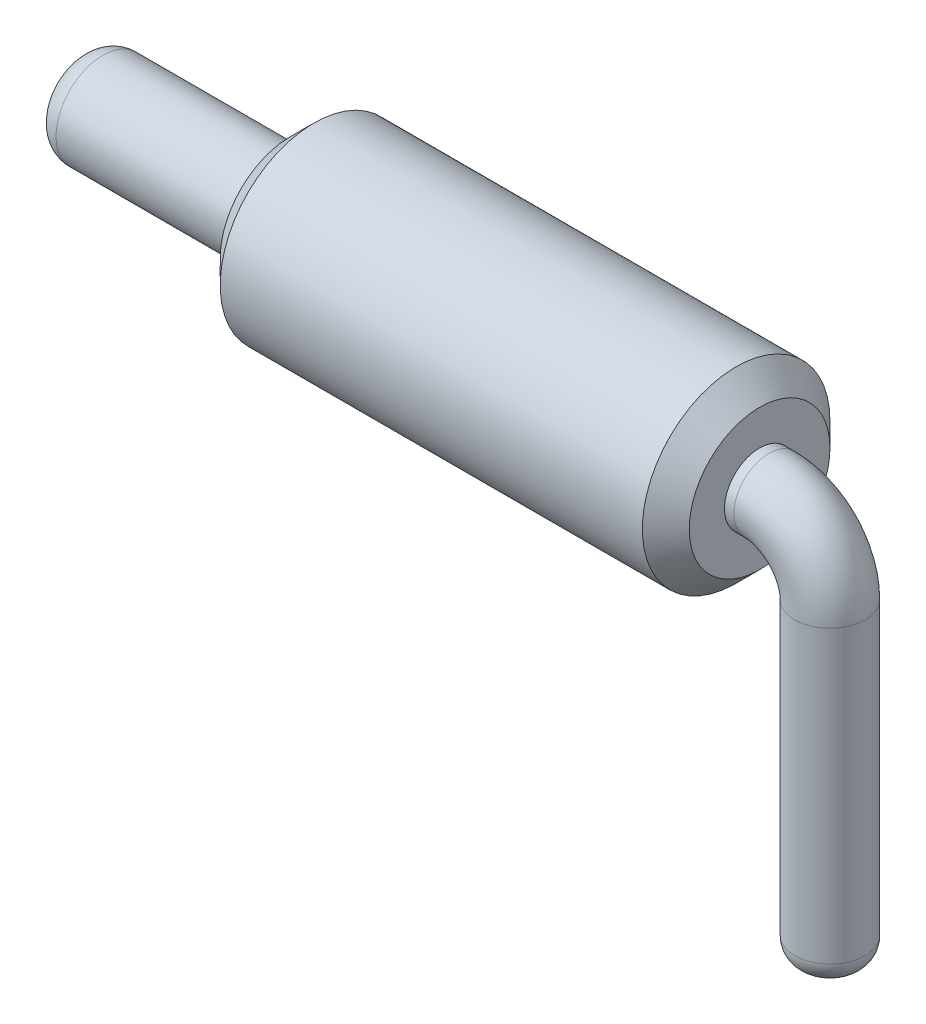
ISO-10303-21;
HEADER;
FILE_DESCRIPTION(('STEP AP214'),'2;1');
FILE_NAME('part.step','',(''),(''),'','','');
FILE_SCHEMA(('AUTOMOTIVE_DESIGN { 1 0 10303 214 1 1 1 1 }'));
ENDSEC;
DATA;
#1=APPLICATION_CONTEXT('core data for automotive mechanical design processes');
#2=APPLICATION_PROTOCOL_DEFINITION('international standard','automotive_design',2000,#1);
#3=PRODUCT_CONTEXT('',#1,'mechanical');
#4=PRODUCT('Part','Part','',(#3));
#5=PRODUCT_RELATED_PRODUCT_CATEGORY('part','',(#4));
#6=PRODUCT_DEFINITION_FORMATION('','',#4);
#7=PRODUCT_DEFINITION_CONTEXT('part definition',#1,'design');
#8=PRODUCT_DEFINITION('design','',#6,#7);
#9=PRODUCT_DEFINITION_SHAPE('','',#8);
#10=(LENGTH_UNIT() NAMED_UNIT(*) SI_UNIT(.MILLI.,.METRE.));
#11=(NAMED_UNIT(*) PLANE_ANGLE_UNIT() SI_UNIT($,.RADIAN.));
#12=(NAMED_UNIT(*) SI_UNIT($,.STERADIAN.) SOLID_ANGLE_UNIT());
#13=UNCERTAINTY_MEASURE_WITH_UNIT(LENGTH_MEASURE(1.E-05),#10,'distance_accuracy_value','');
#14=(GEOMETRIC_REPRESENTATION_CONTEXT(3) GLOBAL_UNCERTAINTY_ASSIGNED_CONTEXT((#13)) GLOBAL_UNIT_ASSIGNED_CONTEXT((#10,
#11,#12)) REPRESENTATION_CONTEXT('',''));
#15=CARTESIAN_POINT('',(0.,0.,0.));
#16=DIRECTION('',(0.,0.,1.));
#17=DIRECTION('',(1.,0.,0.));
#18=AXIS2_PLACEMENT_3D('',#15,#16,#17);
#19=CARTESIAN_POINT('',(10.,0.,0.));
#20=DIRECTION('',(1.,0.,0.));
#21=DIRECTION('',(0.,0.,-1.));
#22=AXIS2_PLACEMENT_3D('',#19,#20,#21);
#23=PLANE('',#22);
#24=CARTESIAN_POINT('',(10.,0.,0.));
#25=DIRECTION('',(1.,0.,0.));
#26=DIRECTION('',(0.,0.,-1.));
#27=AXIS2_PLACEMENT_3D('',#24,#25,#26);
#28=CIRCLE('',#27,1.5);
#29=CARTESIAN_POINT('',(10.,0.,-1.5));
#30=VERTEX_POINT('',#29);
#31=EDGE_CURVE('E61',#30,#30,#28,.T.);
#32=ORIENTED_EDGE('',*,*,#31,.T.);
#33=EDGE_LOOP('',(#32));
#34=FACE_BOUND('',#33,.T.);
#35=CARTESIAN_POINT('',(10.,0.,0.));
#36=DIRECTION('',(1.,0.,0.));
#37=DIRECTION('',(0.,1.,0.));
#38=AXIS2_PLACEMENT_3D('',#35,#36,#37);
#39=CIRCLE('',#38,0.75);
#40=CARTESIAN_POINT('',(10.,0.750000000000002,0.));
#41=VERTEX_POINT('',#40);
#42=EDGE_CURVE('E67',#41,#41,#39,.T.);
#43=ORIENTED_EDGE('',*,*,#42,.F.);
#44=EDGE_LOOP('',(#43));
#45=FACE_BOUND('',#44,.T.);
#46=ADVANCED_FACE('F32',(#34,#45),#23,.T.);
#47=CARTESIAN_POINT('',(0.,0.,0.));
#48=DIRECTION('',(1.,0.,0.));
#49=DIRECTION('',(0.,0.,-1.));
#50=AXIS2_PLACEMENT_3D('',#47,#48,#49);
#51=PLANE('',#50);
#52=CARTESIAN_POINT('',(0.,0.,0.));
#53=DIRECTION('',(1.,0.,0.));
#54=DIRECTION('',(0.,0.,-1.));
#55=AXIS2_PLACEMENT_3D('',#52,#53,#54);
#56=CIRCLE('',#55,1.49999999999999);
#57=CARTESIAN_POINT('',(0.,0.,-1.49999999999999));
#58=VERTEX_POINT('',#57);
#59=EDGE_CURVE('E52',#58,#58,#56,.F.);
#60=ORIENTED_EDGE('',*,*,#59,.T.);
#61=EDGE_LOOP('',(#60));
#62=FACE_BOUND('',#61,.T.);
#63=CARTESIAN_POINT('',(0.,0.,0.));
#64=DIRECTION('',(1.,0.,0.));
#65=DIRECTION('',(0.,0.,-1.));
#66=AXIS2_PLACEMENT_3D('',#63,#64,#65);
#67=CIRCLE('',#66,1.);
#68=CARTESIAN_POINT('',(0.,0.,-1.));
#69=VERTEX_POINT('',#68);
#70=EDGE_CURVE('E64',#69,#69,#67,.F.);
#71=ORIENTED_EDGE('',*,*,#70,.F.);
#72=EDGE_LOOP('',(#71));
#73=FACE_BOUND('',#72,.T.);
#74=ADVANCED_FACE('F93',(#62,#73),#51,.F.);
#75=CARTESIAN_POINT('',(10.,0.,0.));
#76=DIRECTION('',(-1.,0.,0.));
#77=DIRECTION('',(0.,0.,1.));
#78=AXIS2_PLACEMENT_3D('',#75,#76,#77);
#79=CYLINDRICAL_SURFACE('',#78,2.);
#80=CARTESIAN_POINT('',(9.5,0.,0.));
#81=DIRECTION('',(1.,0.,0.));
#82=DIRECTION('',(0.,0.,-1.));
#83=AXIS2_PLACEMENT_3D('',#80,#81,#82);
#84=CIRCLE('',#83,2.);
#85=CARTESIAN_POINT('',(9.5,0.,-2.));
#86=VERTEX_POINT('',#85);
#87=EDGE_CURVE('E55',#86,#86,#84,.F.);
#88=ORIENTED_EDGE('',*,*,#87,.T.);
#89=EDGE_LOOP('',(#88));
#90=FACE_BOUND('',#89,.T.);
#91=CARTESIAN_POINT('',(0.500000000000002,0.,0.));
#92=DIRECTION('',(1.,0.,0.));
#93=DIRECTION('',(0.,0.,-1.));
#94=AXIS2_PLACEMENT_3D('',#91,#92,#93);
#95=CIRCLE('',#94,2.);
#96=CARTESIAN_POINT('',(0.500000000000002,0.,-2.));
#97=VERTEX_POINT('',#96);
#98=EDGE_CURVE('E58',#97,#97,#95,.T.);
#99=ORIENTED_EDGE('',*,*,#98,.T.);
#100=EDGE_LOOP('',(#99));
#101=FACE_BOUND('',#100,.T.);
#102=ADVANCED_FACE('F99',(#90,#101),#79,.T.);
#103=CARTESIAN_POINT('',(-4.5,0.,0.));
#104=DIRECTION('',(1.,0.,0.));
#105=DIRECTION('',(0.,0.,-1.));
#106=AXIS2_PLACEMENT_3D('',#103,#104,#105);
#107=CYLINDRICAL_SURFACE('',#106,1.);
#108=CARTESIAN_POINT('',(-4.,0.,0.));
#109=DIRECTION('',(-1.,0.,0.));
#110=DIRECTION('',(0.,0.,1.));
#111=AXIS2_PLACEMENT_3D('',#108,#109,#110);
#112=CIRCLE('',#111,1.);
#113=CARTESIAN_POINT('',(-4.,0.,1.));
#114=VERTEX_POINT('',#113);
#115=EDGE_CURVE('E10',#114,#114,#112,.F.);
#116=ORIENTED_EDGE('',*,*,#115,.T.);
#117=EDGE_LOOP('',(#116));
#118=FACE_BOUND('',#117,.T.);
#119=ORIENTED_EDGE('',*,*,#70,.T.);
#120=EDGE_LOOP('',(#119));
#121=FACE_BOUND('',#120,.T.);
#122=ADVANCED_FACE('F103',(#118,#121),#107,.T.);
#123=CARTESIAN_POINT('',(-4.5,0.,0.));
#124=DIRECTION('',(-1.,0.,0.));
#125=DIRECTION('',(0.,0.,1.));
#126=AXIS2_PLACEMENT_3D('',#123,#124,#125);
#127=PLANE('',#126);
#128=CARTESIAN_POINT('',(-4.5,0.,0.));
#129=DIRECTION('',(-1.,0.,0.));
#130=DIRECTION('',(0.,0.,1.));
#131=AXIS2_PLACEMENT_3D('',#128,#129,#130);
#132=CIRCLE('',#131,0.5);
#133=CARTESIAN_POINT('',(-4.5,0.,0.5));
#134=VERTEX_POINT('',#133);
#135=EDGE_CURVE('E39',#134,#134,#132,.T.);
#136=ORIENTED_EDGE('',*,*,#135,.T.);
#137=EDGE_LOOP('',(#136));
#138=FACE_BOUND('',#137,.T.);
#139=ADVANCED_FACE('F88',(#138),#127,.T.);
#140=CARTESIAN_POINT('',(10.2,0.,0.));
#141=DIRECTION('',(-1.,0.,0.));
#142=DIRECTION('',(0.,0.,1.));
#143=AXIS2_PLACEMENT_3D('',#140,#141,#142);
#144=CYLINDRICAL_SURFACE('',#143,0.75);
#145=CARTESIAN_POINT('',(10.2,0.,0.));
#146=DIRECTION('',(1.,0.,0.));
#147=DIRECTION('',(0.,1.,0.));
#148=AXIS2_PLACEMENT_3D('',#145,#146,#147);
#149=CIRCLE('',#148,0.75);
#150=CARTESIAN_POINT('',(10.2,0.750000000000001,0.));
#151=VERTEX_POINT('',#150);
#152=EDGE_CURVE('E70',#151,#151,#149,.T.);
#153=ORIENTED_EDGE('',*,*,#152,.F.);
#154=EDGE_LOOP('',(#153));
#155=FACE_BOUND('',#154,.T.);
#156=ORIENTED_EDGE('',*,*,#42,.T.);
#157=EDGE_LOOP('',(#156));
#158=FACE_BOUND('',#157,.T.);
#159=ADVANCED_FACE('F82',(#155,#158),#144,.T.);
#160=CARTESIAN_POINT('',(10.2,-1.3,0.));
#161=DIRECTION('',(0.,0.,1.));
#162=DIRECTION('',(1.,0.,0.));
#163=AXIS2_PLACEMENT_3D('',#160,#161,#162);
#164=TOROIDAL_SURFACE('',#163,1.3,0.75);
#165=CARTESIAN_POINT('',(11.5,-1.3,0.));
#166=DIRECTION('',(0.,-1.,0.));
#167=DIRECTION('',(1.,0.,0.));
#168=AXIS2_PLACEMENT_3D('',#165,#166,#167);
#169=CIRCLE('',#168,0.75);
#170=CARTESIAN_POINT('',(12.25,-1.3,0.));
#171=VERTEX_POINT('',#170);
#172=EDGE_CURVE('E73',#171,#171,#169,.T.);
#173=CARTESIAN_POINT('',(10.2,-1.3,0.));
#174=DIRECTION('',(0.,0.,1.));
#175=DIRECTION('',(1.,0.,0.));
#176=AXIS2_PLACEMENT_3D('',#173,#174,#175);
#177=CIRCLE('',#176,2.05);
#178=EDGE_CURVE('',#171,#151,#177,.T.);
#179=ORIENTED_EDGE('',*,*,#172,.F.);
#180=ORIENTED_EDGE('',*,*,#152,.T.);
#181=ORIENTED_EDGE('',*,*,#178,.T.);
#182=ORIENTED_EDGE('',*,*,#178,.F.);
#183=EDGE_LOOP('',(#179,#181,#180,#182));
#184=FACE_BOUND('',#183,.T.);
#185=ADVANCED_FACE('F79',(#184),#164,.T.);
#186=CARTESIAN_POINT('',(11.5,-1.3,0.));
#187=DIRECTION('',(0.,-1.,0.));
#188=DIRECTION('',(0.,0.,-1.));
#189=AXIS2_PLACEMENT_3D('',#186,#187,#188);
#190=CYLINDRICAL_SURFACE('',#189,0.75);
#191=CARTESIAN_POINT('',(11.5,-7.5,0.));
#192=DIRECTION('',(0.,-1.,0.));
#193=DIRECTION('',(1.,0.,0.));
#194=AXIS2_PLACEMENT_3D('',#191,#192,#193);
#195=CIRCLE('',#194,0.75);
#196=CARTESIAN_POINT('',(12.25,-7.5,0.));
#197=VERTEX_POINT('',#196);
#198=EDGE_CURVE('E43',#197,#197,#195,.F.);
#199=ORIENTED_EDGE('',*,*,#198,.T.);
#200=EDGE_LOOP('',(#199));
#201=FACE_BOUND('',#200,.T.);
#202=ORIENTED_EDGE('',*,*,#172,.T.);
#203=EDGE_LOOP('',(#202));
#204=FACE_BOUND('',#203,.T.);
#205=ADVANCED_FACE('F77',(#201,#204),#190,.T.);
#206=CARTESIAN_POINT('',(11.5,-8.,0.));
#207=DIRECTION('',(0.,-1.,0.));
#208=DIRECTION('',(1.,0.,0.));
#209=AXIS2_PLACEMENT_3D('',#206,#207,#208);
#210=PLANE('',#209);
#211=CARTESIAN_POINT('',(11.5,-8.,0.));
#212=DIRECTION('',(0.,-1.,0.));
#213=DIRECTION('',(1.,0.,0.));
#214=AXIS2_PLACEMENT_3D('',#211,#212,#213);
#215=CIRCLE('',#214,0.25);
#216=CARTESIAN_POINT('',(11.75,-8.,0.));
#217=VERTEX_POINT('',#216);
#218=EDGE_CURVE('E47',#217,#217,#215,.T.);
#219=ORIENTED_EDGE('',*,*,#218,.T.);
#220=EDGE_LOOP('',(#219));
#221=FACE_BOUND('',#220,.T.);
#222=ADVANCED_FACE('F113',(#221),#210,.T.);
#223=CARTESIAN_POINT('',(10.,0.,0.));
#224=DIRECTION('',(-1.,0.,0.));
#225=DIRECTION('',(0.,0.,1.));
#226=AXIS2_PLACEMENT_3D('',#223,#224,#225);
#227=CONICAL_SURFACE('',#226,1.5,0.785398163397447);
#228=ORIENTED_EDGE('',*,*,#87,.F.);
#229=EDGE_LOOP('',(#228));
#230=FACE_BOUND('',#229,.T.);
#231=ORIENTED_EDGE('',*,*,#31,.F.);
#232=EDGE_LOOP('',(#231));
#233=FACE_BOUND('',#232,.T.);
#234=ADVANCED_FACE('F109',(#230,#233),#227,.T.);
#235=CARTESIAN_POINT('',(0.500000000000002,0.,0.));
#236=DIRECTION('',(1.,0.,0.));
#237=DIRECTION('',(0.,0.,-1.));
#238=AXIS2_PLACEMENT_3D('',#235,#236,#237);
#239=CONICAL_SURFACE('',#238,2.,0.78539816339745);
#240=ORIENTED_EDGE('',*,*,#59,.F.);
#241=EDGE_LOOP('',(#240));
#242=FACE_BOUND('',#241,.T.);
#243=ORIENTED_EDGE('',*,*,#98,.F.);
#244=EDGE_LOOP('',(#243));
#245=FACE_BOUND('',#244,.T.);
#246=ADVANCED_FACE('F112',(#242,#245),#239,.T.);
#247=CARTESIAN_POINT('',(11.5,-7.5,0.));
#248=DIRECTION('',(0.,-1.,0.));
#249=DIRECTION('',(1.,0.,0.));
#250=AXIS2_PLACEMENT_3D('',#247,#248,#249);
#251=DEGENERATE_TOROIDAL_SURFACE('',#250,0.25,0.5,.T.);
#252=ORIENTED_EDGE('',*,*,#198,.F.);
#253=EDGE_LOOP('',(#252));
#254=FACE_BOUND('',#253,.T.);
#255=ORIENTED_EDGE('',*,*,#218,.F.);
#256=EDGE_LOOP('',(#255));
#257=FACE_BOUND('',#256,.T.);
#258=ADVANCED_FACE('F116',(#254,#257),#251,.T.);
#259=CARTESIAN_POINT('',(-4.,0.,0.));
#260=DIRECTION('',(-1.,0.,0.));
#261=DIRECTION('',(0.,0.,1.));
#262=AXIS2_PLACEMENT_3D('',#259,#260,#261);
#263=DEGENERATE_TOROIDAL_SURFACE('',#262,0.5,0.5,.T.);
#264=ORIENTED_EDGE('',*,*,#115,.F.);
#265=EDGE_LOOP('',(#264));
#266=FACE_BOUND('',#265,.T.);
#267=ORIENTED_EDGE('',*,*,#135,.F.);
#268=EDGE_LOOP('',(#267));
#269=FACE_BOUND('',#268,.T.);
#270=ADVANCED_FACE('F34',(#266,#269),#263,.T.);
#271=CLOSED_SHELL('',(#46,#74,#102,#122,#139,#159,#185,#205,#222,#234,#246,#258,#270));
#272=MANIFOLD_SOLID_BREP('B2',#271);
#273=ADVANCED_BREP_SHAPE_REPRESENTATION('',(#18,#272),#14);
#274=SHAPE_DEFINITION_REPRESENTATION(#9,#273);
ENDSEC;
END-ISO-10303-21;
